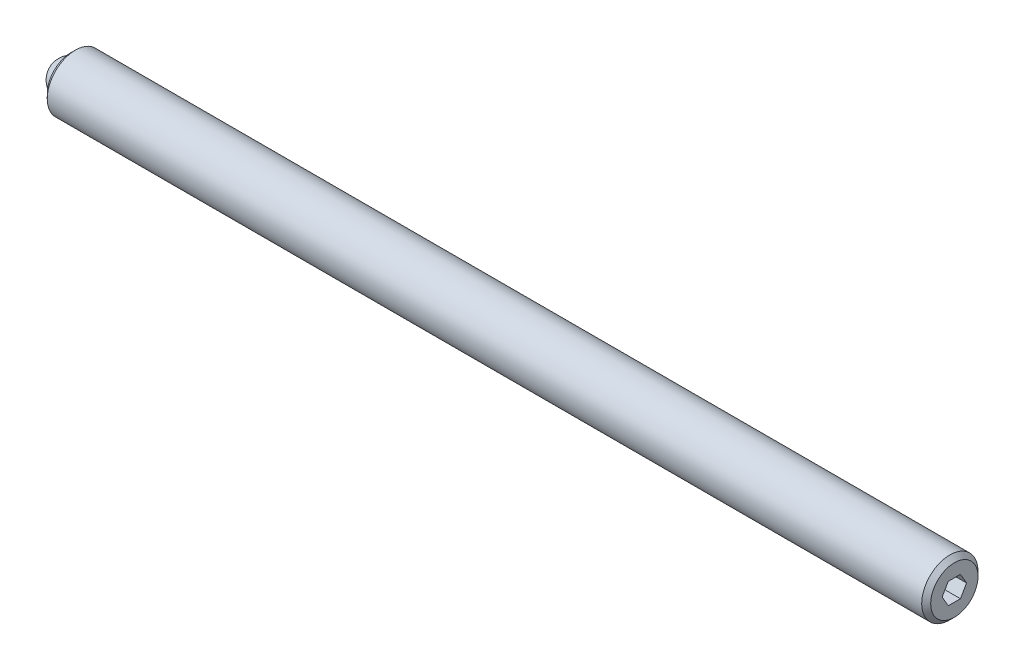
from build123d import *

# Parameters (mm, degrees)
SKETCH2_R           = 3.175
BOSS_EXTRUDE1_DEPTH = 99.615625
CHAMFER1_SIZE       = 0.508
CHAMFER2_SIZE       = 0.508
CUT_EXTRUDE2_DEPTH  = 2.286
SKETCH3_R           = 1.9812
CUT_EXTRUDE3_DEPTH  = 1.984375


with BuildPart() as part:
    # Sketch2 → Boss-Extrude1 (new body)
    with BuildSketch(Plane(origin=(0, 0, 0), x_dir=(0, 0, -1), z_dir=(1, 0, 0))):
        with Locations(Location((0, 0, 0), (0, 0, 180))):
            Circle(SKETCH2_R)
    extrude(amount=BOSS_EXTRUDE1_DEPTH)

    # Chamfer1
    chamfer1_edges = [part.edges().sort_by_distance(p)[0] for p in [
        (0, 0, -3.175),
    ]]
    chamfer(chamfer1_edges, length=CHAMFER1_SIZE)

    # Chamfer2
    chamfer2_edges = [part.edges().sort_by_distance(p)[0] for p in [
        (99.615625, 0, -3.175),
    ]]
    chamfer(chamfer2_edges, length=CHAMFER2_SIZE)

    # Sketch4 → Cut-Extrude2 (cut)
    with BuildSketch(Plane(origin=(99.615625, 0, 0), x_dir=(0, 0, -1), z_dir=(1, 0, 0))):
        Polygon((1.374815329, 0), (0.687407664, 1.190625), (-0.687407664, 1.190625), (-1.374815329, 0), (-0.687407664, -1.190625), (0.687407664, -1.190625), align=None)
    extrude(amount=-CUT_EXTRUDE2_DEPTH, mode=Mode.SUBTRACT)

    # Sketch3 → Cut-Extrude3 (cut)
    with BuildSketch(Plane.ZY):
        Circle(SKETCH3_R)
    extrude(amount=-CUT_EXTRUDE3_DEPTH, mode=Mode.SUBTRACT)


with BuildPart() as body_2:
    # Sketch5 → Revolve1 (revolve)
    with BuildSketch(Plane.ZY):
        with BuildLine():
            Line((0, 0), (0, -1.984375))
            ThreePointArc((0, -1.984375), (-1.984375, 0), (0, 1.984375))
            Line((0, 1.984375), (0, 0))
        make_face()
    revolve(axis=Axis((0, 0, 0), (0, 1, 0)))


solid = Compound([part.part, body_2.part])
